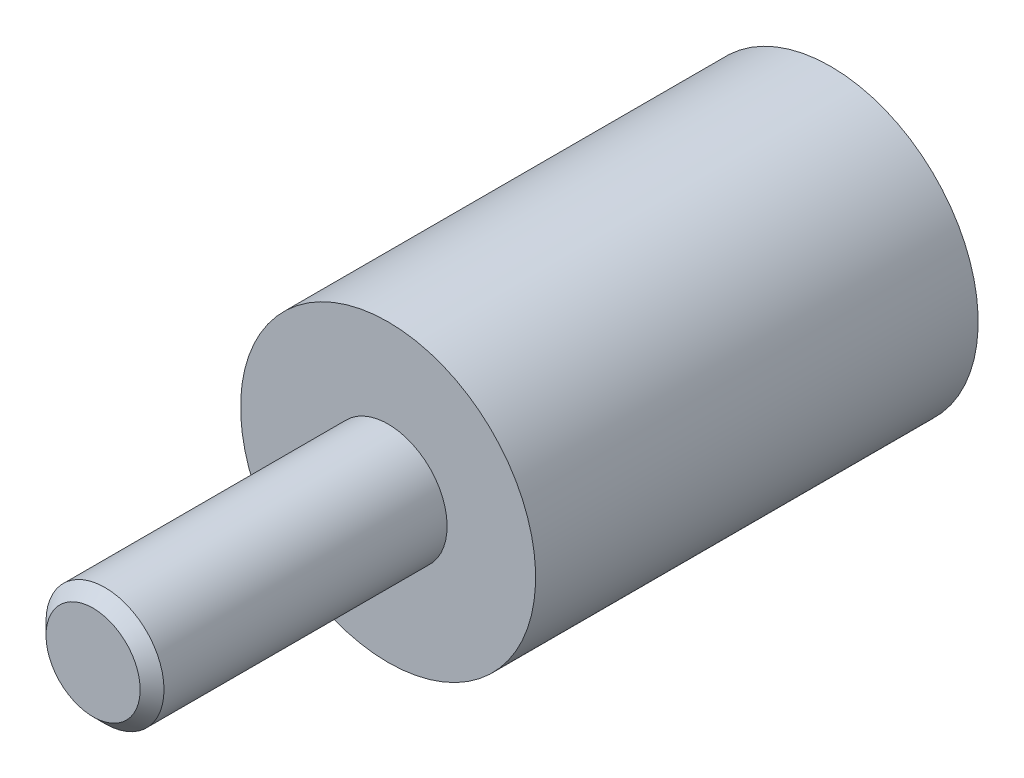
ISO-10303-21;
HEADER;
FILE_DESCRIPTION(('STEP AP214'),'2;1');
FILE_NAME('part.step','',(''),(''),'','','');
FILE_SCHEMA(('AUTOMOTIVE_DESIGN { 1 0 10303 214 1 1 1 1 }'));
ENDSEC;
DATA;
#1=APPLICATION_CONTEXT('core data for automotive mechanical design processes');
#2=APPLICATION_PROTOCOL_DEFINITION('international standard','automotive_design',2000,#1);
#3=PRODUCT_CONTEXT('',#1,'mechanical');
#4=PRODUCT('Part','Part','',(#3));
#5=PRODUCT_RELATED_PRODUCT_CATEGORY('part','',(#4));
#6=PRODUCT_DEFINITION_FORMATION('','',#4);
#7=PRODUCT_DEFINITION_CONTEXT('part definition',#1,'design');
#8=PRODUCT_DEFINITION('design','',#6,#7);
#9=PRODUCT_DEFINITION_SHAPE('','',#8);
#10=(LENGTH_UNIT() NAMED_UNIT(*) SI_UNIT(.MILLI.,.METRE.));
#11=(NAMED_UNIT(*) PLANE_ANGLE_UNIT() SI_UNIT($,.RADIAN.));
#12=(NAMED_UNIT(*) SI_UNIT($,.STERADIAN.) SOLID_ANGLE_UNIT());
#13=UNCERTAINTY_MEASURE_WITH_UNIT(LENGTH_MEASURE(1.E-05),#10,'distance_accuracy_value','');
#14=(GEOMETRIC_REPRESENTATION_CONTEXT(3) GLOBAL_UNCERTAINTY_ASSIGNED_CONTEXT((#13)) GLOBAL_UNIT_ASSIGNED_CONTEXT((#10,
#11,#12)) REPRESENTATION_CONTEXT('',''));
#15=CARTESIAN_POINT('',(0.,0.,0.));
#16=DIRECTION('',(0.,0.,1.));
#17=DIRECTION('',(1.,0.,0.));
#18=AXIS2_PLACEMENT_3D('',#15,#16,#17);
#19=CARTESIAN_POINT('',(0.,0.,0.));
#20=DIRECTION('',(0.,0.,1.));
#21=DIRECTION('',(0.,-1.,0.));
#22=AXIS2_PLACEMENT_3D('',#19,#20,#21);
#23=CYLINDRICAL_SURFACE('',#22,5.);
#24=CARTESIAN_POINT('',(0.,0.,0.));
#25=DIRECTION('',(0.,0.,1.));
#26=DIRECTION('',(0.,-1.,0.));
#27=AXIS2_PLACEMENT_3D('',#24,#25,#26);
#28=CIRCLE('',#27,5.);
#29=CARTESIAN_POINT('',(0.,-5.,0.));
#30=VERTEX_POINT('',#29);
#31=EDGE_CURVE('E18',#30,#30,#28,.T.);
#32=ORIENTED_EDGE('',*,*,#31,.T.);
#33=EDGE_LOOP('',(#32));
#34=FACE_BOUND('',#33,.T.);
#35=CARTESIAN_POINT('',(0.,0.,15.));
#36=DIRECTION('',(0.,0.,-1.));
#37=DIRECTION('',(0.,1.,0.));
#38=AXIS2_PLACEMENT_3D('',#35,#36,#37);
#39=CIRCLE('',#38,5.);
#40=CARTESIAN_POINT('',(0.,5.,15.));
#41=VERTEX_POINT('',#40);
#42=EDGE_CURVE('E22',#41,#41,#39,.T.);
#43=ORIENTED_EDGE('',*,*,#42,.T.);
#44=EDGE_LOOP('',(#43));
#45=FACE_BOUND('',#44,.T.);
#46=ADVANCED_FACE('F12',(#34,#45),#23,.T.);
#47=CARTESIAN_POINT('',(5.,0.,0.));
#48=DIRECTION('',(0.,0.,-1.));
#49=DIRECTION('',(0.,1.,0.));
#50=AXIS2_PLACEMENT_3D('',#47,#48,#49);
#51=PLANE('',#50);
#52=ORIENTED_EDGE('',*,*,#31,.F.);
#53=EDGE_LOOP('',(#52));
#54=FACE_BOUND('',#53,.T.);
#55=ADVANCED_FACE('F48',(#54),#51,.T.);
#56=CARTESIAN_POINT('',(5.,0.,15.));
#57=DIRECTION('',(0.,0.,1.));
#58=DIRECTION('',(0.,-1.,0.));
#59=AXIS2_PLACEMENT_3D('',#56,#57,#58);
#60=PLANE('',#59);
#61=CARTESIAN_POINT('',(0.,0.,15.));
#62=DIRECTION('',(0.,0.,1.));
#63=DIRECTION('',(0.,-1.,0.));
#64=AXIS2_PLACEMENT_3D('',#61,#62,#63);
#65=CIRCLE('',#64,2.);
#66=CARTESIAN_POINT('',(0.,-2.,15.));
#67=VERTEX_POINT('',#66);
#68=EDGE_CURVE('E8',#67,#67,#65,.F.);
#69=ORIENTED_EDGE('',*,*,#68,.T.);
#70=EDGE_LOOP('',(#69));
#71=FACE_BOUND('',#70,.T.);
#72=ORIENTED_EDGE('',*,*,#42,.F.);
#73=EDGE_LOOP('',(#72));
#74=FACE_BOUND('',#73,.T.);
#75=ADVANCED_FACE('F52',(#71,#74),#60,.T.);
#76=CARTESIAN_POINT('',(0.,0.,10.));
#77=DIRECTION('',(0.,0.,1.));
#78=DIRECTION('',(0.,-1.,0.));
#79=AXIS2_PLACEMENT_3D('',#76,#77,#78);
#80=CYLINDRICAL_SURFACE('',#79,2.);
#81=ORIENTED_EDGE('',*,*,#68,.F.);
#82=EDGE_LOOP('',(#81));
#83=FACE_BOUND('',#82,.T.);
#84=CARTESIAN_POINT('',(0.,0.,24.595863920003));
#85=DIRECTION('',(0.,0.,-1.));
#86=DIRECTION('',(0.,1.,0.));
#87=AXIS2_PLACEMENT_3D('',#84,#85,#86);
#88=CIRCLE('',#87,2.);
#89=CARTESIAN_POINT('',(0.,2.,24.595863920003));
#90=VERTEX_POINT('',#89);
#91=EDGE_CURVE('E26',#90,#90,#88,.T.);
#92=ORIENTED_EDGE('',*,*,#91,.T.);
#93=EDGE_LOOP('',(#92));
#94=FACE_BOUND('',#93,.T.);
#95=ADVANCED_FACE('F45',(#83,#94),#80,.T.);
#96=CARTESIAN_POINT('',(0.,0.,24.595863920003));
#97=DIRECTION('',(0.,0.,-1.));
#98=DIRECTION('',(0.,1.,0.));
#99=AXIS2_PLACEMENT_3D('',#96,#97,#98);
#100=CONICAL_SURFACE('',#99,2.,0.785398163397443);
#101=CARTESIAN_POINT('',(0.,0.,25.));
#102=DIRECTION('',(0.,0.,-1.));
#103=DIRECTION('',(0.,1.,0.));
#104=AXIS2_PLACEMENT_3D('',#101,#102,#103);
#105=CIRCLE('',#104,1.59586392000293);
#106=CARTESIAN_POINT('',(0.,1.59586392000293,25.));
#107=VERTEX_POINT('',#106);
#108=EDGE_CURVE('E31',#107,#107,#105,.T.);
#109=ORIENTED_EDGE('',*,*,#108,.T.);
#110=EDGE_LOOP('',(#109));
#111=FACE_BOUND('',#110,.T.);
#112=ORIENTED_EDGE('',*,*,#91,.F.);
#113=EDGE_LOOP('',(#112));
#114=FACE_BOUND('',#113,.T.);
#115=ADVANCED_FACE('F35',(#111,#114),#100,.T.);
#116=CARTESIAN_POINT('',(1.59586392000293,0.,25.));
#117=DIRECTION('',(0.,0.,1.));
#118=DIRECTION('',(0.,-1.,0.));
#119=AXIS2_PLACEMENT_3D('',#116,#117,#118);
#120=PLANE('',#119);
#121=ORIENTED_EDGE('',*,*,#108,.F.);
#122=EDGE_LOOP('',(#121));
#123=FACE_BOUND('',#122,.T.);
#124=ADVANCED_FACE('F38',(#123),#120,.T.);
#125=CLOSED_SHELL('',(#46,#55,#75,#95,#115,#124));
#126=MANIFOLD_SOLID_BREP('B1',#125);
#127=ADVANCED_BREP_SHAPE_REPRESENTATION('',(#18,#126),#14);
#128=SHAPE_DEFINITION_REPRESENTATION(#9,#127);
ENDSEC;
END-ISO-10303-21;
